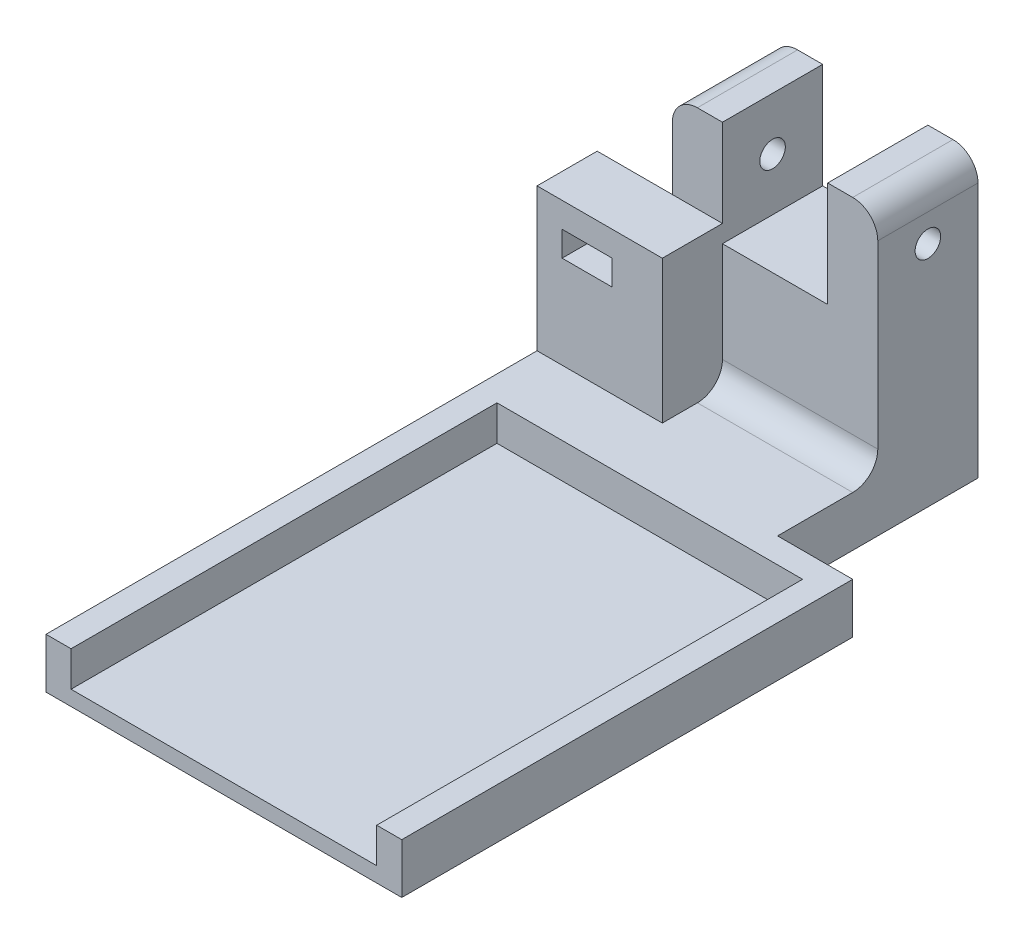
ISO-10303-21;
HEADER;
FILE_DESCRIPTION(('STEP AP214'),'2;1');
FILE_NAME('part.step','',(''),(''),'','','');
FILE_SCHEMA(('AUTOMOTIVE_DESIGN { 1 0 10303 214 1 1 1 1 }'));
ENDSEC;
DATA;
#1=APPLICATION_CONTEXT('core data for automotive mechanical design processes');
#2=APPLICATION_PROTOCOL_DEFINITION('international standard','automotive_design',2000,#1);
#3=PRODUCT_CONTEXT('',#1,'mechanical');
#4=PRODUCT('Part','Part','',(#3));
#5=PRODUCT_RELATED_PRODUCT_CATEGORY('part','',(#4));
#6=PRODUCT_DEFINITION_FORMATION('','',#4);
#7=PRODUCT_DEFINITION_CONTEXT('part definition',#1,'design');
#8=PRODUCT_DEFINITION('design','',#6,#7);
#9=PRODUCT_DEFINITION_SHAPE('','',#8);
#10=(LENGTH_UNIT() NAMED_UNIT(*) SI_UNIT(.MILLI.,.METRE.));
#11=(NAMED_UNIT(*) PLANE_ANGLE_UNIT() SI_UNIT($,.RADIAN.));
#12=(NAMED_UNIT(*) SI_UNIT($,.STERADIAN.) SOLID_ANGLE_UNIT());
#13=UNCERTAINTY_MEASURE_WITH_UNIT(LENGTH_MEASURE(1.E-05),#10,'distance_accuracy_value','');
#14=(GEOMETRIC_REPRESENTATION_CONTEXT(3) GLOBAL_UNCERTAINTY_ASSIGNED_CONTEXT((#13)) GLOBAL_UNIT_ASSIGNED_CONTEXT((#10,
#11,#12)) REPRESENTATION_CONTEXT('',''));
#15=CARTESIAN_POINT('',(0.,0.,0.));
#16=DIRECTION('',(0.,0.,1.));
#17=DIRECTION('',(1.,0.,0.));
#18=AXIS2_PLACEMENT_3D('',#15,#16,#17);
#19=CARTESIAN_POINT('',(-10.5,20.5,20.));
#20=DIRECTION('',(1.,0.,0.));
#21=DIRECTION('',(0.,1.,0.));
#22=AXIS2_PLACEMENT_3D('',#19,#20,#21);
#23=PLANE('',#22);
#24=DIRECTION('',(0.,-1.,0.));
#25=VECTOR('',#24,1.);
#26=CARTESIAN_POINT('',(-10.5,20.5,20.));
#27=LINE('',#26,#25);
#28=CARTESIAN_POINT('',(-10.5,15.5,20.));
#29=VERTEX_POINT('',#28);
#30=CARTESIAN_POINT('',(-10.5,3.,20.));
#31=VERTEX_POINT('',#30);
#32=EDGE_CURVE('E427',#29,#31,#27,.T.);
#33=ORIENTED_EDGE('',*,*,#32,.F.);
#34=DIRECTION('',(0.,0.,-1.));
#35=VECTOR('',#34,1.);
#36=CARTESIAN_POINT('',(-10.5,15.5,20.));
#37=LINE('',#36,#35);
#38=CARTESIAN_POINT('',(-10.5,15.5,0.));
#39=VERTEX_POINT('',#38);
#40=EDGE_CURVE('E518',#29,#39,#37,.T.);
#41=ORIENTED_EDGE('',*,*,#40,.T.);
#42=DIRECTION('',(0.,-1.,0.));
#43=VECTOR('',#42,1.);
#44=CARTESIAN_POINT('',(-10.5,20.5,0.));
#45=LINE('',#44,#43);
#46=CARTESIAN_POINT('',(-10.5,-35.5,0.));
#47=VERTEX_POINT('',#46);
#48=EDGE_CURVE('E450',#39,#47,#45,.T.);
#49=ORIENTED_EDGE('',*,*,#48,.T.);
#50=DIRECTION('',(0.,0.,-1.));
#51=VECTOR('',#50,1.);
#52=CARTESIAN_POINT('',(-10.5,-35.5,20.));
#53=LINE('',#52,#51);
#54=CARTESIAN_POINT('',(-10.5,-35.5,20.));
#55=VERTEX_POINT('',#54);
#56=EDGE_CURVE('E489',#55,#47,#53,.T.);
#57=ORIENTED_EDGE('',*,*,#56,.F.);
#58=DIRECTION('',(0.,-1.,0.));
#59=VECTOR('',#58,1.);
#60=CARTESIAN_POINT('',(-10.5,-25.5,20.));
#61=LINE('',#60,#59);
#62=CARTESIAN_POINT('',(-10.5,-7.00000000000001,20.));
#63=VERTEX_POINT('',#62);
#64=EDGE_CURVE('E284',#63,#55,#61,.T.);
#65=ORIENTED_EDGE('',*,*,#64,.F.);
#66=DIRECTION('',(0.,0.,1.));
#67=VECTOR('',#66,1.);
#68=CARTESIAN_POINT('',(-10.5,-7.00000000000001,0.));
#69=LINE('',#68,#67);
#70=CARTESIAN_POINT('',(-10.5,-7.00000000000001,32.));
#71=VERTEX_POINT('',#70);
#72=EDGE_CURVE('E241',#63,#71,#69,.T.);
#73=ORIENTED_EDGE('',*,*,#72,.T.);
#74=DIRECTION('',(0.,1.,0.));
#75=VECTOR('',#74,1.);
#76=CARTESIAN_POINT('',(-10.5,-2.00000000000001,32.));
#77=LINE('',#76,#75);
#78=CARTESIAN_POINT('',(-10.5,-2.00000000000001,32.));
#79=VERTEX_POINT('',#78);
#80=EDGE_CURVE('E257',#71,#79,#77,.T.);
#81=ORIENTED_EDGE('',*,*,#80,.T.);
#82=DIRECTION('',(0.,0.,1.));
#83=VECTOR('',#82,1.);
#84=CARTESIAN_POINT('',(-10.5,-2.00000000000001,0.));
#85=LINE('',#84,#83);
#86=CARTESIAN_POINT('',(-10.5,-2.00000000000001,20.));
#87=VERTEX_POINT('',#86);
#88=EDGE_CURVE('E264',#87,#79,#85,.T.);
#89=ORIENTED_EDGE('',*,*,#88,.F.);
#90=EDGE_CURVE('E290',#31,#87,#61,.T.);
#91=ORIENTED_EDGE('',*,*,#90,.F.);
#92=EDGE_LOOP('',(#33,#41,#49,#57,#65,#73,#81,#89,#91));
#93=FACE_BOUND('',#92,.T.);
#94=CARTESIAN_POINT('',(-10.5,9.99999999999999,10.));
#95=DIRECTION('',(-1.,0.,0.));
#96=DIRECTION('',(0.,-1.,0.));
#97=AXIS2_PLACEMENT_3D('',#94,#95,#96);
#98=CIRCLE('',#97,2.55);
#99=CARTESIAN_POINT('',(-10.5,7.44999999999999,10.));
#100=VERTEX_POINT('',#99);
#101=EDGE_CURVE('E267',#100,#100,#98,.T.);
#102=ORIENTED_EDGE('',*,*,#101,.F.);
#103=EDGE_LOOP('',(#102));
#104=FACE_BOUND('',#103,.T.);
#105=ADVANCED_FACE('F45',(#93,#104),#23,.F.);
#106=CARTESIAN_POINT('',(0.,0.,20.));
#107=DIRECTION('',(0.,0.,-1.));
#108=DIRECTION('',(-1.,0.,0.));
#109=AXIS2_PLACEMENT_3D('',#106,#107,#108);
#110=PLANE('',#109);
#111=DIRECTION('',(0.,-1.,0.));
#112=VECTOR('',#111,1.);
#113=CARTESIAN_POINT('',(-0.499999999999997,3.,20.));
#114=LINE('',#113,#112);
#115=CARTESIAN_POINT('',(-0.499999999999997,-0.5,20.));
#116=VERTEX_POINT('',#115);
#117=CARTESIAN_POINT('',(-0.499999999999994,-20.5,20.));
#118=VERTEX_POINT('',#117);
#119=EDGE_CURVE('E308',#116,#118,#114,.T.);
#120=ORIENTED_EDGE('',*,*,#119,.T.);
#121=DIRECTION('',(-1.,0.,0.));
#122=VECTOR('',#121,1.);
#123=CARTESIAN_POINT('',(30.5,-20.5,20.));
#124=LINE('',#123,#122);
#125=CARTESIAN_POINT('',(30.5,-20.5,20.));
#126=VERTEX_POINT('',#125);
#127=EDGE_CURVE('E515',#118,#126,#124,.F.);
#128=ORIENTED_EDGE('',*,*,#127,.T.);
#129=DIRECTION('',(0.,1.,0.));
#130=VECTOR('',#129,1.);
#131=CARTESIAN_POINT('',(30.5,-35.5,20.));
#132=LINE('',#131,#130);
#133=CARTESIAN_POINT('',(30.5,15.5,20.));
#134=VERTEX_POINT('',#133);
#135=EDGE_CURVE('E431',#126,#134,#132,.T.);
#136=ORIENTED_EDGE('',*,*,#135,.T.);
#137=CARTESIAN_POINT('',(25.5,15.5,20.));
#138=DIRECTION('',(0.,0.,-1.));
#139=DIRECTION('',(-1.,0.,0.));
#140=AXIS2_PLACEMENT_3D('',#137,#138,#139);
#141=CIRCLE('',#140,5.);
#142=CARTESIAN_POINT('',(25.5,20.5,20.));
#143=VERTEX_POINT('',#142);
#144=EDGE_CURVE('E512',#134,#143,#141,.F.);
#145=ORIENTED_EDGE('',*,*,#144,.T.);
#146=DIRECTION('',(-1.,0.,0.));
#147=VECTOR('',#146,1.);
#148=CARTESIAN_POINT('',(20.5,20.5,20.));
#149=LINE('',#148,#147);
#150=CARTESIAN_POINT('',(20.5,20.5,20.));
#151=VERTEX_POINT('',#150);
#152=EDGE_CURVE('E435',#143,#151,#149,.T.);
#153=ORIENTED_EDGE('',*,*,#152,.T.);
#154=DIRECTION('',(0.,-1.,0.));
#155=VECTOR('',#154,1.);
#156=CARTESIAN_POINT('',(20.5,20.5,20.));
#157=LINE('',#156,#155);
#158=CARTESIAN_POINT('',(20.5,-0.5,20.));
#159=VERTEX_POINT('',#158);
#160=EDGE_CURVE('E438',#151,#159,#157,.T.);
#161=ORIENTED_EDGE('',*,*,#160,.T.);
#162=DIRECTION('',(-1.,0.,0.));
#163=VECTOR('',#162,1.);
#164=CARTESIAN_POINT('',(-0.499999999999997,-0.5,20.));
#165=LINE('',#164,#163);
#166=EDGE_CURVE('E441',#159,#116,#165,.T.);
#167=ORIENTED_EDGE('',*,*,#166,.T.);
#168=EDGE_LOOP('',(#120,#128,#136,#145,#153,#161,#167));
#169=FACE_BOUND('',#168,.T.);
#170=ADVANCED_FACE('F544',(#169),#110,.F.);
#171=CARTESIAN_POINT('',(-10.5,-25.5,130.));
#172=DIRECTION('',(0.,-1.,0.));
#173=DIRECTION('',(0.,0.,-1.));
#174=AXIS2_PLACEMENT_3D('',#171,#172,#173);
#175=PLANE('',#174);
#176=DIRECTION('',(0.,0.,-1.));
#177=VECTOR('',#176,1.);
#178=CARTESIAN_POINT('',(30.5,-25.5,130.));
#179=LINE('',#178,#177);
#180=CARTESIAN_POINT('',(30.5,-25.5,40.));
#181=VERTEX_POINT('',#180);
#182=CARTESIAN_POINT('',(30.5,-25.5,25.));
#183=VERTEX_POINT('',#182);
#184=EDGE_CURVE('E419',#181,#183,#179,.T.);
#185=ORIENTED_EDGE('',*,*,#184,.T.);
#186=DIRECTION('',(-1.,0.,0.));
#187=VECTOR('',#186,1.);
#188=CARTESIAN_POINT('',(-0.499999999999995,-25.5,25.));
#189=LINE('',#188,#187);
#190=CARTESIAN_POINT('',(-0.499999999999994,-25.5,25.));
#191=VERTEX_POINT('',#190);
#192=EDGE_CURVE('E505',#183,#191,#189,.T.);
#193=ORIENTED_EDGE('',*,*,#192,.T.);
#194=DIRECTION('',(0.,0.,1.));
#195=VECTOR('',#194,1.);
#196=CARTESIAN_POINT('',(-0.499999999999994,-25.5,20.));
#197=LINE('',#196,#195);
#198=CARTESIAN_POINT('',(-0.499999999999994,-25.5,32.));
#199=VERTEX_POINT('',#198);
#200=EDGE_CURVE('E312',#191,#199,#197,.T.);
#201=ORIENTED_EDGE('',*,*,#200,.T.);
#202=DIRECTION('',(-1.,0.,0.));
#203=VECTOR('',#202,1.);
#204=CARTESIAN_POINT('',(-0.499999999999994,-25.5,32.));
#205=LINE('',#204,#203);
#206=CARTESIAN_POINT('',(-25.5,-25.5,32.));
#207=VERTEX_POINT('',#206);
#208=EDGE_CURVE('E323',#199,#207,#205,.T.);
#209=ORIENTED_EDGE('',*,*,#208,.T.);
#210=DIRECTION('',(0.,0.,-1.));
#211=VECTOR('',#210,1.);
#212=CARTESIAN_POINT('',(-25.5,-25.5,130.));
#213=LINE('',#212,#211);
#214=CARTESIAN_POINT('',(-25.5,-25.5,130.));
#215=VERTEX_POINT('',#214);
#216=EDGE_CURVE('E404',#215,#207,#213,.T.);
#217=ORIENTED_EDGE('',*,*,#216,.F.);
#218=DIRECTION('',(-1.,0.,0.));
#219=VECTOR('',#218,1.);
#220=CARTESIAN_POINT('',(-10.5,-25.5,130.));
#221=LINE('',#220,#219);
#222=CARTESIAN_POINT('',(-20.5,-25.5,130.));
#223=VERTEX_POINT('',#222);
#224=EDGE_CURVE('E414',#223,#215,#221,.T.);
#225=ORIENTED_EDGE('',*,*,#224,.F.);
#226=DIRECTION('',(0.,0.,1.));
#227=VECTOR('',#226,1.);
#228=CARTESIAN_POINT('',(-20.5,-25.5,45.));
#229=LINE('',#228,#227);
#230=CARTESIAN_POINT('',(-20.5,-25.5,45.));
#231=VERTEX_POINT('',#230);
#232=EDGE_CURVE('E346',#231,#223,#229,.T.);
#233=ORIENTED_EDGE('',*,*,#232,.F.);
#234=DIRECTION('',(-1.,0.,0.));
#235=VECTOR('',#234,1.);
#236=CARTESIAN_POINT('',(40.5,-25.5,45.));
#237=LINE('',#236,#235);
#238=CARTESIAN_POINT('',(40.5,-25.5,45.));
#239=VERTEX_POINT('',#238);
#240=EDGE_CURVE('E362',#239,#231,#237,.T.);
#241=ORIENTED_EDGE('',*,*,#240,.F.);
#242=DIRECTION('',(0.,0.,-1.));
#243=VECTOR('',#242,1.);
#244=CARTESIAN_POINT('',(40.5,-25.5,125.));
#245=LINE('',#244,#243);
#246=CARTESIAN_POINT('',(40.5,-25.5,130.));
#247=VERTEX_POINT('',#246);
#248=EDGE_CURVE('E351',#247,#239,#245,.T.);
#249=ORIENTED_EDGE('',*,*,#248,.F.);
#250=CARTESIAN_POINT('',(45.5,-25.5,130.));
#251=VERTEX_POINT('',#250);
#252=EDGE_CURVE('E415',#251,#247,#221,.T.);
#253=ORIENTED_EDGE('',*,*,#252,.F.);
#254=DIRECTION('',(0.,0.,1.));
#255=VECTOR('',#254,1.);
#256=CARTESIAN_POINT('',(45.5,-25.5,130.));
#257=LINE('',#256,#255);
#258=CARTESIAN_POINT('',(45.5,-25.5,40.));
#259=VERTEX_POINT('',#258);
#260=EDGE_CURVE('E385',#259,#251,#257,.T.);
#261=ORIENTED_EDGE('',*,*,#260,.F.);
#262=DIRECTION('',(-1.,0.,0.));
#263=VECTOR('',#262,1.);
#264=CARTESIAN_POINT('',(45.5,-25.5,40.));
#265=LINE('',#264,#263);
#266=EDGE_CURVE('E389',#259,#181,#265,.T.);
#267=ORIENTED_EDGE('',*,*,#266,.T.);
#268=EDGE_LOOP('',(#185,#193,#201,#209,#217,#225,#233,#241,#249,#253,#261,#267));
#269=FACE_BOUND('',#268,.T.);
#270=ADVANCED_FACE('F570',(#269),#175,.F.);
#271=CARTESIAN_POINT('',(30.5,-35.5,20.));
#272=DIRECTION('',(-1.,0.,0.));
#273=DIRECTION('',(0.,0.,1.));
#274=AXIS2_PLACEMENT_3D('',#271,#272,#273);
#275=PLANE('',#274);
#276=CARTESIAN_POINT('',(30.5,10.,10.));
#277=DIRECTION('',(-1.,0.,0.));
#278=DIRECTION('',(0.,0.,1.));
#279=AXIS2_PLACEMENT_3D('',#276,#277,#278);
#280=CIRCLE('',#279,2.55);
#281=CARTESIAN_POINT('',(30.5,10.,12.55));
#282=VERTEX_POINT('',#281);
#283=EDGE_CURVE('E280',#282,#282,#280,.T.);
#284=ORIENTED_EDGE('',*,*,#283,.T.);
#285=EDGE_LOOP('',(#284));
#286=FACE_BOUND('',#285,.T.);
#287=DIRECTION('',(0.,1.,0.));
#288=VECTOR('',#287,1.);
#289=CARTESIAN_POINT('',(30.5,-35.5,0.));
#290=LINE('',#289,#288);
#291=CARTESIAN_POINT('',(30.5,-35.5,0.));
#292=VERTEX_POINT('',#291);
#293=CARTESIAN_POINT('',(30.5,15.5,0.));
#294=VERTEX_POINT('',#293);
#295=EDGE_CURVE('E457',#292,#294,#290,.T.);
#296=ORIENTED_EDGE('',*,*,#295,.T.);
#297=DIRECTION('',(0.,0.,-1.));
#298=VECTOR('',#297,1.);
#299=CARTESIAN_POINT('',(30.5,15.5,20.));
#300=LINE('',#299,#298);
#301=EDGE_CURVE('E54',#294,#134,#300,.F.);
#302=ORIENTED_EDGE('',*,*,#301,.T.);
#303=ORIENTED_EDGE('',*,*,#135,.F.);
#304=CARTESIAN_POINT('',(30.5,-20.5,25.));
#305=DIRECTION('',(-1.,0.,0.));
#306=DIRECTION('',(0.,0.,1.));
#307=AXIS2_PLACEMENT_3D('',#304,#305,#306);
#308=CIRCLE('',#307,5.);
#309=EDGE_CURVE('E11',#126,#183,#308,.T.);
#310=ORIENTED_EDGE('',*,*,#309,.T.);
#311=ORIENTED_EDGE('',*,*,#184,.F.);
#312=DIRECTION('',(0.,1.,0.));
#313=VECTOR('',#312,1.);
#314=CARTESIAN_POINT('',(30.5,-35.5,40.));
#315=LINE('',#314,#313);
#316=CARTESIAN_POINT('',(30.5,-35.5,40.));
#317=VERTEX_POINT('',#316);
#318=EDGE_CURVE('E374',#317,#181,#315,.T.);
#319=ORIENTED_EDGE('',*,*,#318,.F.);
#320=DIRECTION('',(0.,0.,-1.));
#321=VECTOR('',#320,1.);
#322=CARTESIAN_POINT('',(30.5,-35.5,20.));
#323=LINE('',#322,#321);
#324=EDGE_CURVE('E486',#317,#292,#323,.T.);
#325=ORIENTED_EDGE('',*,*,#324,.T.);
#326=EDGE_LOOP('',(#296,#302,#303,#310,#311,#319,#325));
#327=FACE_BOUND('',#326,.T.);
#328=ADVANCED_FACE('F539',(#286,#327),#275,.F.);
#329=DIRECTION('',(-1.,0.,0.));
#330=VECTOR('',#329,1.);
#331=CARTESIAN_POINT('',(-10.5,20.5,20.));
#332=LINE('',#331,#330);
#333=CARTESIAN_POINT('',(-0.499999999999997,20.5,20.));
#334=VERTEX_POINT('',#333);
#335=CARTESIAN_POINT('',(-5.5,20.5,20.));
#336=VERTEX_POINT('',#335);
#337=EDGE_CURVE('E424',#334,#336,#332,.T.);
#338=ORIENTED_EDGE('',*,*,#337,.T.);
#339=CARTESIAN_POINT('',(-5.5,15.5,20.));
#340=DIRECTION('',(0.,0.,-1.));
#341=DIRECTION('',(-1.,0.,0.));
#342=AXIS2_PLACEMENT_3D('',#339,#340,#341);
#343=CIRCLE('',#342,5.);
#344=EDGE_CURVE('E529',#336,#29,#343,.F.);
#345=ORIENTED_EDGE('',*,*,#344,.T.);
#346=ORIENTED_EDGE('',*,*,#32,.T.);
#347=DIRECTION('',(-1.,0.,0.));
#348=VECTOR('',#347,1.);
#349=CARTESIAN_POINT('',(-0.499999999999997,3.,20.));
#350=LINE('',#349,#348);
#351=CARTESIAN_POINT('',(-0.499999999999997,3.,20.));
#352=VERTEX_POINT('',#351);
#353=EDGE_CURVE('E324',#352,#31,#350,.T.);
#354=ORIENTED_EDGE('',*,*,#353,.F.);
#355=DIRECTION('',(0.,1.,0.));
#356=VECTOR('',#355,1.);
#357=CARTESIAN_POINT('',(-0.499999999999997,20.5,20.));
#358=LINE('',#357,#356);
#359=EDGE_CURVE('E444',#352,#334,#358,.T.);
#360=ORIENTED_EDGE('',*,*,#359,.T.);
#361=EDGE_LOOP('',(#338,#345,#346,#354,#360));
#362=FACE_BOUND('',#361,.T.);
#363=ADVANCED_FACE('F595',(#362),#110,.F.);
#364=CARTESIAN_POINT('',(-10.5,20.5,20.));
#365=DIRECTION('',(0.,-1.,0.));
#366=DIRECTION('',(0.,0.,-1.));
#367=AXIS2_PLACEMENT_3D('',#364,#365,#366);
#368=PLANE('',#367);
#369=DIRECTION('',(-1.,0.,0.));
#370=VECTOR('',#369,1.);
#371=CARTESIAN_POINT('',(-10.5,20.5,0.));
#372=LINE('',#371,#370);
#373=CARTESIAN_POINT('',(-0.499999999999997,20.5,0.));
#374=VERTEX_POINT('',#373);
#375=CARTESIAN_POINT('',(-5.5,20.5,0.));
#376=VERTEX_POINT('',#375);
#377=EDGE_CURVE('E423',#374,#376,#372,.T.);
#378=ORIENTED_EDGE('',*,*,#377,.T.);
#379=DIRECTION('',(0.,0.,-1.));
#380=VECTOR('',#379,1.);
#381=CARTESIAN_POINT('',(-5.5,20.5,20.));
#382=LINE('',#381,#380);
#383=EDGE_CURVE('E61',#376,#336,#382,.F.);
#384=ORIENTED_EDGE('',*,*,#383,.T.);
#385=ORIENTED_EDGE('',*,*,#337,.F.);
#386=DIRECTION('',(0.,0.,-1.));
#387=VECTOR('',#386,1.);
#388=CARTESIAN_POINT('',(-0.499999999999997,20.5,20.));
#389=LINE('',#388,#387);
#390=EDGE_CURVE('E447',#334,#374,#389,.T.);
#391=ORIENTED_EDGE('',*,*,#390,.T.);
#392=EDGE_LOOP('',(#378,#384,#385,#391));
#393=FACE_BOUND('',#392,.T.);
#394=ADVANCED_FACE('F598',(#393),#368,.F.);
#395=CARTESIAN_POINT('',(-10.5,-35.5,20.));
#396=DIRECTION('',(0.,1.,0.));
#397=DIRECTION('',(0.,0.,1.));
#398=AXIS2_PLACEMENT_3D('',#395,#396,#397);
#399=PLANE('',#398);
#400=DIRECTION('',(1.,0.,0.));
#401=VECTOR('',#400,1.);
#402=CARTESIAN_POINT('',(-25.5,-35.5,20.));
#403=LINE('',#402,#401);
#404=CARTESIAN_POINT('',(-25.5,-35.5,20.));
#405=VERTEX_POINT('',#404);
#406=EDGE_CURVE('E304',#405,#55,#403,.T.);
#407=ORIENTED_EDGE('',*,*,#406,.T.);
#408=ORIENTED_EDGE('',*,*,#56,.T.);
#409=DIRECTION('',(1.,0.,0.));
#410=VECTOR('',#409,1.);
#411=CARTESIAN_POINT('',(-10.5,-35.5,0.));
#412=LINE('',#411,#410);
#413=EDGE_CURVE('E453',#47,#292,#412,.T.);
#414=ORIENTED_EDGE('',*,*,#413,.T.);
#415=ORIENTED_EDGE('',*,*,#324,.F.);
#416=DIRECTION('',(-1.,0.,0.));
#417=VECTOR('',#416,1.);
#418=CARTESIAN_POINT('',(45.5,-35.5,40.));
#419=LINE('',#418,#417);
#420=CARTESIAN_POINT('',(45.5,-35.5,40.));
#421=VERTEX_POINT('',#420);
#422=EDGE_CURVE('E396',#421,#317,#419,.T.);
#423=ORIENTED_EDGE('',*,*,#422,.F.);
#424=DIRECTION('',(0.,0.,-1.));
#425=VECTOR('',#424,1.);
#426=CARTESIAN_POINT('',(45.5,-35.5,130.));
#427=LINE('',#426,#425);
#428=CARTESIAN_POINT('',(45.5,-35.5,130.));
#429=VERTEX_POINT('',#428);
#430=EDGE_CURVE('E379',#429,#421,#427,.T.);
#431=ORIENTED_EDGE('',*,*,#430,.F.);
#432=DIRECTION('',(1.,0.,0.));
#433=VECTOR('',#432,1.);
#434=CARTESIAN_POINT('',(-10.5,-35.5,130.));
#435=LINE('',#434,#433);
#436=CARTESIAN_POINT('',(-25.5,-35.5,130.));
#437=VERTEX_POINT('',#436);
#438=EDGE_CURVE('E411',#437,#429,#435,.T.);
#439=ORIENTED_EDGE('',*,*,#438,.F.);
#440=DIRECTION('',(0.,0.,1.));
#441=VECTOR('',#440,1.);
#442=CARTESIAN_POINT('',(-25.5,-35.5,130.));
#443=LINE('',#442,#441);
#444=EDGE_CURVE('E407',#405,#437,#443,.T.);
#445=ORIENTED_EDGE('',*,*,#444,.F.);
#446=EDGE_LOOP('',(#407,#408,#414,#415,#423,#431,#439,#445));
#447=FACE_BOUND('',#446,.T.);
#448=ADVANCED_FACE('F580',(#447),#399,.F.);
#449=CARTESIAN_POINT('',(20.5,20.5,20.));
#450=DIRECTION('',(0.,-1.,0.));
#451=DIRECTION('',(1.,0.,0.));
#452=AXIS2_PLACEMENT_3D('',#449,#450,#451);
#453=PLANE('',#452);
#454=ORIENTED_EDGE('',*,*,#152,.F.);
#455=DIRECTION('',(0.,0.,-1.));
#456=VECTOR('',#455,1.);
#457=CARTESIAN_POINT('',(25.5,20.5,20.));
#458=LINE('',#457,#456);
#459=CARTESIAN_POINT('',(25.5,20.5,0.));
#460=VERTEX_POINT('',#459);
#461=EDGE_CURVE('E532',#143,#460,#458,.T.);
#462=ORIENTED_EDGE('',*,*,#461,.T.);
#463=DIRECTION('',(-1.,0.,0.));
#464=VECTOR('',#463,1.);
#465=CARTESIAN_POINT('',(20.5,20.5,0.));
#466=LINE('',#465,#464);
#467=CARTESIAN_POINT('',(20.5,20.5,0.));
#468=VERTEX_POINT('',#467);
#469=EDGE_CURVE('E460',#460,#468,#466,.T.);
#470=ORIENTED_EDGE('',*,*,#469,.T.);
#471=DIRECTION('',(0.,0.,-1.));
#472=VECTOR('',#471,1.);
#473=CARTESIAN_POINT('',(20.5,20.5,20.));
#474=LINE('',#473,#472);
#475=EDGE_CURVE('E482',#151,#468,#474,.T.);
#476=ORIENTED_EDGE('',*,*,#475,.F.);
#477=EDGE_LOOP('',(#454,#462,#470,#476));
#478=FACE_BOUND('',#477,.T.);
#479=ADVANCED_FACE('F549',(#478),#453,.F.);
#480=CARTESIAN_POINT('',(20.5,20.5,20.));
#481=DIRECTION('',(1.,0.,0.));
#482=DIRECTION('',(0.,1.,0.));
#483=AXIS2_PLACEMENT_3D('',#480,#481,#482);
#484=PLANE('',#483);
#485=CARTESIAN_POINT('',(20.5,10.,10.));
#486=DIRECTION('',(1.,0.,0.));
#487=DIRECTION('',(0.,1.,0.));
#488=AXIS2_PLACEMENT_3D('',#485,#486,#487);
#489=CIRCLE('',#488,2.55);
#490=CARTESIAN_POINT('',(20.5,12.55,10.));
#491=VERTEX_POINT('',#490);
#492=EDGE_CURVE('E276',#491,#491,#489,.T.);
#493=ORIENTED_EDGE('',*,*,#492,.T.);
#494=EDGE_LOOP('',(#493));
#495=FACE_BOUND('',#494,.T.);
#496=DIRECTION('',(0.,-1.,0.));
#497=VECTOR('',#496,1.);
#498=CARTESIAN_POINT('',(20.5,20.5,0.));
#499=LINE('',#498,#497);
#500=CARTESIAN_POINT('',(20.5,-0.5,0.));
#501=VERTEX_POINT('',#500);
#502=EDGE_CURVE('E463',#468,#501,#499,.T.);
#503=ORIENTED_EDGE('',*,*,#502,.T.);
#504=DIRECTION('',(0.,0.,-1.));
#505=VECTOR('',#504,1.);
#506=CARTESIAN_POINT('',(20.5,-0.5,20.));
#507=LINE('',#506,#505);
#508=EDGE_CURVE('E478',#159,#501,#507,.T.);
#509=ORIENTED_EDGE('',*,*,#508,.F.);
#510=ORIENTED_EDGE('',*,*,#160,.F.);
#511=ORIENTED_EDGE('',*,*,#475,.T.);
#512=EDGE_LOOP('',(#503,#509,#510,#511));
#513=FACE_BOUND('',#512,.T.);
#514=ADVANCED_FACE('F558',(#495,#513),#484,.F.);
#515=CARTESIAN_POINT('',(-0.499999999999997,-0.5,20.));
#516=DIRECTION('',(0.,-1.,0.));
#517=DIRECTION('',(0.,0.,-1.));
#518=AXIS2_PLACEMENT_3D('',#515,#516,#517);
#519=PLANE('',#518);
#520=DIRECTION('',(-1.,0.,0.));
#521=VECTOR('',#520,1.);
#522=CARTESIAN_POINT('',(-0.499999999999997,-0.5,0.));
#523=LINE('',#522,#521);
#524=CARTESIAN_POINT('',(-0.499999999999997,-0.5,0.));
#525=VERTEX_POINT('',#524);
#526=EDGE_CURVE('E466',#501,#525,#523,.T.);
#527=ORIENTED_EDGE('',*,*,#526,.T.);
#528=DIRECTION('',(0.,0.,-1.));
#529=VECTOR('',#528,1.);
#530=CARTESIAN_POINT('',(-0.499999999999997,-0.5,20.));
#531=LINE('',#530,#529);
#532=EDGE_CURVE('E474',#116,#525,#531,.T.);
#533=ORIENTED_EDGE('',*,*,#532,.F.);
#534=ORIENTED_EDGE('',*,*,#166,.F.);
#535=ORIENTED_EDGE('',*,*,#508,.T.);
#536=EDGE_LOOP('',(#527,#533,#534,#535));
#537=FACE_BOUND('',#536,.T.);
#538=ADVANCED_FACE('F562',(#537),#519,.F.);
#539=CARTESIAN_POINT('',(-0.499999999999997,20.5,20.));
#540=DIRECTION('',(-1.,0.,0.));
#541=DIRECTION('',(0.,0.,1.));
#542=AXIS2_PLACEMENT_3D('',#539,#540,#541);
#543=PLANE('',#542);
#544=CARTESIAN_POINT('',(-0.5,9.99999999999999,10.));
#545=DIRECTION('',(-1.,0.,0.));
#546=DIRECTION('',(0.,0.,1.));
#547=AXIS2_PLACEMENT_3D('',#544,#545,#546);
#548=CIRCLE('',#547,2.55);
#549=CARTESIAN_POINT('',(-0.5,9.99999999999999,12.55));
#550=VERTEX_POINT('',#549);
#551=EDGE_CURVE('E275',#550,#550,#548,.T.);
#552=ORIENTED_EDGE('',*,*,#551,.T.);
#553=EDGE_LOOP('',(#552));
#554=FACE_BOUND('',#553,.T.);
#555=ORIENTED_EDGE('',*,*,#200,.F.);
#556=CARTESIAN_POINT('',(-0.499999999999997,-20.5,25.));
#557=DIRECTION('',(-1.,0.,0.));
#558=DIRECTION('',(0.,0.,1.));
#559=AXIS2_PLACEMENT_3D('',#556,#557,#558);
#560=CIRCLE('',#559,5.);
#561=EDGE_CURVE('E509',#191,#118,#560,.F.);
#562=ORIENTED_EDGE('',*,*,#561,.T.);
#563=ORIENTED_EDGE('',*,*,#119,.F.);
#564=ORIENTED_EDGE('',*,*,#532,.T.);
#565=DIRECTION('',(0.,1.,0.));
#566=VECTOR('',#565,1.);
#567=CARTESIAN_POINT('',(-0.499999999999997,20.5,0.));
#568=LINE('',#567,#566);
#569=EDGE_CURVE('E428',#525,#374,#568,.T.);
#570=ORIENTED_EDGE('',*,*,#569,.T.);
#571=ORIENTED_EDGE('',*,*,#390,.F.);
#572=ORIENTED_EDGE('',*,*,#359,.F.);
#573=DIRECTION('',(0.,0.,-1.));
#574=VECTOR('',#573,1.);
#575=CARTESIAN_POINT('',(-0.499999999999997,3.,20.));
#576=LINE('',#575,#574);
#577=CARTESIAN_POINT('',(-0.499999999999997,3.,32.));
#578=VERTEX_POINT('',#577);
#579=EDGE_CURVE('E319',#578,#352,#576,.T.);
#580=ORIENTED_EDGE('',*,*,#579,.F.);
#581=DIRECTION('',(0.,1.,0.));
#582=VECTOR('',#581,1.);
#583=CARTESIAN_POINT('',(-0.499999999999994,-25.5,32.));
#584=LINE('',#583,#582);
#585=EDGE_CURVE('E315',#199,#578,#584,.T.);
#586=ORIENTED_EDGE('',*,*,#585,.F.);
#587=EDGE_LOOP('',(#555,#562,#563,#564,#570,#571,#572,#580,#586));
#588=FACE_BOUND('',#587,.T.);
#589=ADVANCED_FACE('F599',(#554,#588),#543,.F.);
#590=CARTESIAN_POINT('',(0.,0.,0.));
#591=DIRECTION('',(0.,0.,-1.));
#592=DIRECTION('',(-1.,0.,0.));
#593=AXIS2_PLACEMENT_3D('',#590,#591,#592);
#594=PLANE('',#593);
#595=ORIENTED_EDGE('',*,*,#48,.F.);
#596=CARTESIAN_POINT('',(-5.5,15.5,0.));
#597=DIRECTION('',(0.,0.,-1.));
#598=DIRECTION('',(-1.,0.,0.));
#599=AXIS2_PLACEMENT_3D('',#596,#597,#598);
#600=CIRCLE('',#599,5.);
#601=EDGE_CURVE('E524',#39,#376,#600,.T.);
#602=ORIENTED_EDGE('',*,*,#601,.T.);
#603=ORIENTED_EDGE('',*,*,#377,.F.);
#604=ORIENTED_EDGE('',*,*,#569,.F.);
#605=ORIENTED_EDGE('',*,*,#526,.F.);
#606=ORIENTED_EDGE('',*,*,#502,.F.);
#607=ORIENTED_EDGE('',*,*,#469,.F.);
#608=CARTESIAN_POINT('',(25.5,15.5,0.));
#609=DIRECTION('',(0.,0.,-1.));
#610=DIRECTION('',(-1.,0.,0.));
#611=AXIS2_PLACEMENT_3D('',#608,#609,#610);
#612=CIRCLE('',#611,5.);
#613=EDGE_CURVE('E69',#460,#294,#612,.T.);
#614=ORIENTED_EDGE('',*,*,#613,.T.);
#615=ORIENTED_EDGE('',*,*,#295,.F.);
#616=ORIENTED_EDGE('',*,*,#413,.F.);
#617=EDGE_LOOP('',(#595,#602,#603,#604,#605,#606,#607,#614,#615,#616));
#618=FACE_BOUND('',#617,.T.);
#619=ADVANCED_FACE('F553',(#618),#594,.T.);
#620=CARTESIAN_POINT('',(0.,0.,130.));
#621=DIRECTION('',(0.,0.,-1.));
#622=DIRECTION('',(-1.,0.,0.));
#623=AXIS2_PLACEMENT_3D('',#620,#621,#622);
#624=PLANE('',#623);
#625=DIRECTION('',(-1.,0.,0.));
#626=VECTOR('',#625,1.);
#627=CARTESIAN_POINT('',(0.,-32.5,130.));
#628=LINE('',#627,#626);
#629=CARTESIAN_POINT('',(40.5,-32.5,130.));
#630=VERTEX_POINT('',#629);
#631=CARTESIAN_POINT('',(-20.5,-32.5,130.));
#632=VERTEX_POINT('',#631);
#633=EDGE_CURVE('E338',#630,#632,#628,.T.);
#634=ORIENTED_EDGE('',*,*,#633,.T.);
#635=DIRECTION('',(0.,1.,0.));
#636=VECTOR('',#635,1.);
#637=CARTESIAN_POINT('',(-20.5,0.,130.));
#638=LINE('',#637,#636);
#639=EDGE_CURVE('E342',#632,#223,#638,.T.);
#640=ORIENTED_EDGE('',*,*,#639,.T.);
#641=ORIENTED_EDGE('',*,*,#224,.T.);
#642=DIRECTION('',(0.,1.,0.));
#643=VECTOR('',#642,1.);
#644=CARTESIAN_POINT('',(-25.5,-35.5,130.));
#645=LINE('',#644,#643);
#646=EDGE_CURVE('E400',#437,#215,#645,.T.);
#647=ORIENTED_EDGE('',*,*,#646,.F.);
#648=ORIENTED_EDGE('',*,*,#438,.T.);
#649=DIRECTION('',(0.,-1.,0.));
#650=VECTOR('',#649,1.);
#651=CARTESIAN_POINT('',(45.5,-35.5,130.));
#652=LINE('',#651,#650);
#653=EDGE_CURVE('E375',#251,#429,#652,.T.);
#654=ORIENTED_EDGE('',*,*,#653,.F.);
#655=ORIENTED_EDGE('',*,*,#252,.T.);
#656=DIRECTION('',(0.,-1.,0.));
#657=VECTOR('',#656,1.);
#658=CARTESIAN_POINT('',(40.5,0.,130.));
#659=LINE('',#658,#657);
#660=EDGE_CURVE('E328',#247,#630,#659,.T.);
#661=ORIENTED_EDGE('',*,*,#660,.T.);
#662=EDGE_LOOP('',(#634,#640,#641,#647,#648,#654,#655,#661));
#663=FACE_BOUND('',#662,.T.);
#664=ADVANCED_FACE('F608',(#663),#624,.F.);
#665=CARTESIAN_POINT('',(-25.5,0.,0.));
#666=DIRECTION('',(-1.,0.,0.));
#667=DIRECTION('',(0.,-1.,0.));
#668=AXIS2_PLACEMENT_3D('',#665,#666,#667);
#669=PLANE('',#668);
#670=ORIENTED_EDGE('',*,*,#646,.T.);
#671=ORIENTED_EDGE('',*,*,#216,.T.);
#672=DIRECTION('',(0.,1.,0.));
#673=VECTOR('',#672,1.);
#674=CARTESIAN_POINT('',(-25.5,3.,32.));
#675=LINE('',#674,#673);
#676=CARTESIAN_POINT('',(-25.5,3.,32.));
#677=VERTEX_POINT('',#676);
#678=EDGE_CURVE('E289',#207,#677,#675,.T.);
#679=ORIENTED_EDGE('',*,*,#678,.T.);
#680=DIRECTION('',(0.,0.,-1.));
#681=VECTOR('',#680,1.);
#682=CARTESIAN_POINT('',(-25.5,3.,20.));
#683=LINE('',#682,#681);
#684=CARTESIAN_POINT('',(-25.5,3.,20.));
#685=VERTEX_POINT('',#684);
#686=EDGE_CURVE('E294',#677,#685,#683,.T.);
#687=ORIENTED_EDGE('',*,*,#686,.T.);
#688=DIRECTION('',(0.,-1.,0.));
#689=VECTOR('',#688,1.);
#690=CARTESIAN_POINT('',(-25.5,3.,20.));
#691=LINE('',#690,#689);
#692=EDGE_CURVE('E285',#685,#405,#691,.T.);
#693=ORIENTED_EDGE('',*,*,#692,.T.);
#694=ORIENTED_EDGE('',*,*,#444,.T.);
#695=EDGE_LOOP('',(#670,#671,#679,#687,#693,#694));
#696=FACE_BOUND('',#695,.T.);
#697=ADVANCED_FACE('F733',(#696),#669,.T.);
#698=CARTESIAN_POINT('',(45.5,-35.5,40.));
#699=DIRECTION('',(0.,0.,1.));
#700=DIRECTION('',(1.,0.,0.));
#701=AXIS2_PLACEMENT_3D('',#698,#699,#700);
#702=PLANE('',#701);
#703=ORIENTED_EDGE('',*,*,#318,.T.);
#704=ORIENTED_EDGE('',*,*,#266,.F.);
#705=DIRECTION('',(0.,1.,0.));
#706=VECTOR('',#705,1.);
#707=CARTESIAN_POINT('',(45.5,-35.5,40.));
#708=LINE('',#707,#706);
#709=EDGE_CURVE('E382',#421,#259,#708,.T.);
#710=ORIENTED_EDGE('',*,*,#709,.F.);
#711=ORIENTED_EDGE('',*,*,#422,.T.);
#712=EDGE_LOOP('',(#703,#704,#710,#711));
#713=FACE_BOUND('',#712,.T.);
#714=ADVANCED_FACE('F576',(#713),#702,.F.);
#715=CARTESIAN_POINT('',(45.5,0.,0.));
#716=DIRECTION('',(-1.,0.,0.));
#717=DIRECTION('',(0.,0.,1.));
#718=AXIS2_PLACEMENT_3D('',#715,#716,#717);
#719=PLANE('',#718);
#720=ORIENTED_EDGE('',*,*,#653,.T.);
#721=ORIENTED_EDGE('',*,*,#430,.T.);
#722=ORIENTED_EDGE('',*,*,#709,.T.);
#723=ORIENTED_EDGE('',*,*,#260,.T.);
#724=EDGE_LOOP('',(#720,#721,#722,#723));
#725=FACE_BOUND('',#724,.T.);
#726=ADVANCED_FACE('F786',(#725),#719,.F.);
#727=CARTESIAN_POINT('',(-20.5,-32.5,45.));
#728=DIRECTION('',(-1.,0.,0.));
#729=DIRECTION('',(0.,0.,1.));
#730=AXIS2_PLACEMENT_3D('',#727,#728,#729);
#731=PLANE('',#730);
#732=ORIENTED_EDGE('',*,*,#232,.T.);
#733=ORIENTED_EDGE('',*,*,#639,.F.);
#734=DIRECTION('',(0.,0.,1.));
#735=VECTOR('',#734,1.);
#736=CARTESIAN_POINT('',(-20.5,-32.5,45.));
#737=LINE('',#736,#735);
#738=CARTESIAN_POINT('',(-20.5,-32.5,45.));
#739=VERTEX_POINT('',#738);
#740=EDGE_CURVE('E347',#739,#632,#737,.T.);
#741=ORIENTED_EDGE('',*,*,#740,.F.);
#742=DIRECTION('',(0.,1.,0.));
#743=VECTOR('',#742,1.);
#744=CARTESIAN_POINT('',(-20.5,-32.5,45.));
#745=LINE('',#744,#743);
#746=EDGE_CURVE('E371',#739,#231,#745,.T.);
#747=ORIENTED_EDGE('',*,*,#746,.T.);
#748=EDGE_LOOP('',(#732,#733,#741,#747));
#749=FACE_BOUND('',#748,.T.);
#750=ADVANCED_FACE('F783',(#749),#731,.F.);
#751=CARTESIAN_POINT('',(40.5,-32.5,45.));
#752=DIRECTION('',(0.,0.,-1.));
#753=DIRECTION('',(-1.,0.,0.));
#754=AXIS2_PLACEMENT_3D('',#751,#752,#753);
#755=PLANE('',#754);
#756=ORIENTED_EDGE('',*,*,#240,.T.);
#757=ORIENTED_EDGE('',*,*,#746,.F.);
#758=DIRECTION('',(-1.,0.,0.));
#759=VECTOR('',#758,1.);
#760=CARTESIAN_POINT('',(40.5,-32.5,45.));
#761=LINE('',#760,#759);
#762=CARTESIAN_POINT('',(40.5,-32.5,45.));
#763=VERTEX_POINT('',#762);
#764=EDGE_CURVE('E350',#763,#739,#761,.T.);
#765=ORIENTED_EDGE('',*,*,#764,.F.);
#766=DIRECTION('',(0.,1.,0.));
#767=VECTOR('',#766,1.);
#768=CARTESIAN_POINT('',(40.5,-32.5,45.));
#769=LINE('',#768,#767);
#770=EDGE_CURVE('E359',#763,#239,#769,.T.);
#771=ORIENTED_EDGE('',*,*,#770,.T.);
#772=EDGE_LOOP('',(#756,#757,#765,#771));
#773=FACE_BOUND('',#772,.T.);
#774=ADVANCED_FACE('F776',(#773),#755,.F.);
#775=CARTESIAN_POINT('',(40.5,-32.5,125.));
#776=DIRECTION('',(1.,0.,0.));
#777=DIRECTION('',(0.,0.,-1.));
#778=AXIS2_PLACEMENT_3D('',#775,#776,#777);
#779=PLANE('',#778);
#780=ORIENTED_EDGE('',*,*,#248,.T.);
#781=ORIENTED_EDGE('',*,*,#770,.F.);
#782=DIRECTION('',(0.,0.,-1.));
#783=VECTOR('',#782,1.);
#784=CARTESIAN_POINT('',(40.5,-32.5,125.));
#785=LINE('',#784,#783);
#786=EDGE_CURVE('E355',#630,#763,#785,.T.);
#787=ORIENTED_EDGE('',*,*,#786,.F.);
#788=ORIENTED_EDGE('',*,*,#660,.F.);
#789=EDGE_LOOP('',(#780,#781,#787,#788));
#790=FACE_BOUND('',#789,.T.);
#791=ADVANCED_FACE('F766',(#790),#779,.F.);
#792=CARTESIAN_POINT('',(0.,-32.5,0.));
#793=DIRECTION('',(0.,1.,0.));
#794=DIRECTION('',(0.,0.,1.));
#795=AXIS2_PLACEMENT_3D('',#792,#793,#794);
#796=PLANE('',#795);
#797=ORIENTED_EDGE('',*,*,#740,.T.);
#798=ORIENTED_EDGE('',*,*,#633,.F.);
#799=ORIENTED_EDGE('',*,*,#786,.T.);
#800=ORIENTED_EDGE('',*,*,#764,.T.);
#801=EDGE_LOOP('',(#797,#798,#799,#800));
#802=FACE_BOUND('',#801,.T.);
#803=ADVANCED_FACE('F725',(#802),#796,.T.);
#804=CARTESIAN_POINT('',(-0.499999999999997,3.,20.));
#805=DIRECTION('',(0.,1.,0.));
#806=DIRECTION('',(-1.,0.,0.));
#807=AXIS2_PLACEMENT_3D('',#804,#805,#806);
#808=PLANE('',#807);
#809=ORIENTED_EDGE('',*,*,#353,.T.);
#810=DIRECTION('',(1.,0.,0.));
#811=VECTOR('',#810,1.);
#812=CARTESIAN_POINT('',(-25.5,3.,20.));
#813=LINE('',#812,#811);
#814=EDGE_CURVE('E297',#685,#31,#813,.T.);
#815=ORIENTED_EDGE('',*,*,#814,.F.);
#816=ORIENTED_EDGE('',*,*,#686,.F.);
#817=DIRECTION('',(-1.,0.,0.));
#818=VECTOR('',#817,1.);
#819=CARTESIAN_POINT('',(-0.499999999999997,3.,32.));
#820=LINE('',#819,#818);
#821=EDGE_CURVE('E329',#578,#677,#820,.T.);
#822=ORIENTED_EDGE('',*,*,#821,.F.);
#823=ORIENTED_EDGE('',*,*,#579,.T.);
#824=EDGE_LOOP('',(#809,#815,#816,#822,#823));
#825=FACE_BOUND('',#824,.T.);
#826=ADVANCED_FACE('F711',(#825),#808,.T.);
#827=CARTESIAN_POINT('',(-0.499999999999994,-25.5,32.));
#828=DIRECTION('',(0.,0.,1.));
#829=DIRECTION('',(1.,0.,0.));
#830=AXIS2_PLACEMENT_3D('',#827,#828,#829);
#831=PLANE('',#830);
#832=DIRECTION('',(-1.,0.,0.));
#833=VECTOR('',#832,1.);
#834=CARTESIAN_POINT('',(-20.5,-2.00000000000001,32.));
#835=LINE('',#834,#833);
#836=CARTESIAN_POINT('',(-20.5,-2.00000000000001,32.));
#837=VERTEX_POINT('',#836);
#838=EDGE_CURVE('E252',#79,#837,#835,.T.);
#839=ORIENTED_EDGE('',*,*,#838,.F.);
#840=ORIENTED_EDGE('',*,*,#80,.F.);
#841=DIRECTION('',(1.,0.,0.));
#842=VECTOR('',#841,1.);
#843=CARTESIAN_POINT('',(-10.5,-7.00000000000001,32.));
#844=LINE('',#843,#842);
#845=CARTESIAN_POINT('',(-20.5,-7.00000000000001,32.));
#846=VERTEX_POINT('',#845);
#847=EDGE_CURVE('E234',#846,#71,#844,.T.);
#848=ORIENTED_EDGE('',*,*,#847,.F.);
#849=DIRECTION('',(0.,-1.,0.));
#850=VECTOR('',#849,1.);
#851=CARTESIAN_POINT('',(-20.5,-2.00000000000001,32.));
#852=LINE('',#851,#850);
#853=EDGE_CURVE('E246',#837,#846,#852,.T.);
#854=ORIENTED_EDGE('',*,*,#853,.F.);
#855=EDGE_LOOP('',(#839,#840,#848,#854));
#856=FACE_BOUND('',#855,.T.);
#857=ORIENTED_EDGE('',*,*,#821,.T.);
#858=ORIENTED_EDGE('',*,*,#678,.F.);
#859=ORIENTED_EDGE('',*,*,#208,.F.);
#860=ORIENTED_EDGE('',*,*,#585,.T.);
#861=EDGE_LOOP('',(#857,#858,#859,#860));
#862=FACE_BOUND('',#861,.T.);
#863=ADVANCED_FACE('F254',(#856,#862),#831,.T.);
#864=CARTESIAN_POINT('',(-25.5,-25.5,20.));
#865=DIRECTION('',(0.,0.,1.));
#866=DIRECTION('',(1.,0.,0.));
#867=AXIS2_PLACEMENT_3D('',#864,#865,#866);
#868=PLANE('',#867);
#869=ORIENTED_EDGE('',*,*,#90,.T.);
#870=DIRECTION('',(-1.,0.,0.));
#871=VECTOR('',#870,1.);
#872=CARTESIAN_POINT('',(-25.5,-2.00000000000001,20.));
#873=LINE('',#872,#871);
#874=CARTESIAN_POINT('',(-20.5,-2.00000000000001,20.));
#875=VERTEX_POINT('',#874);
#876=EDGE_CURVE('E501',#87,#875,#873,.T.);
#877=ORIENTED_EDGE('',*,*,#876,.T.);
#878=DIRECTION('',(0.,-1.,0.));
#879=VECTOR('',#878,1.);
#880=CARTESIAN_POINT('',(-20.5,-25.5,20.));
#881=LINE('',#880,#879);
#882=CARTESIAN_POINT('',(-20.5,-7.00000000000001,20.));
#883=VERTEX_POINT('',#882);
#884=EDGE_CURVE('E493',#875,#883,#881,.T.);
#885=ORIENTED_EDGE('',*,*,#884,.T.);
#886=DIRECTION('',(1.,0.,0.));
#887=VECTOR('',#886,1.);
#888=CARTESIAN_POINT('',(-25.5,-7.00000000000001,20.));
#889=LINE('',#888,#887);
#890=EDGE_CURVE('E237',#883,#63,#889,.T.);
#891=ORIENTED_EDGE('',*,*,#890,.T.);
#892=ORIENTED_EDGE('',*,*,#64,.T.);
#893=ORIENTED_EDGE('',*,*,#406,.F.);
#894=ORIENTED_EDGE('',*,*,#692,.F.);
#895=ORIENTED_EDGE('',*,*,#814,.T.);
#896=EDGE_LOOP('',(#869,#877,#885,#891,#892,#893,#894,#895));
#897=FACE_BOUND('',#896,.T.);
#898=ADVANCED_FACE('F696',(#897),#868,.F.);
#899=CARTESIAN_POINT('',(45.5,10.,10.));
#900=DIRECTION('',(-1.,0.,0.));
#901=DIRECTION('',(0.,-1.,0.));
#902=AXIS2_PLACEMENT_3D('',#899,#900,#901);
#903=CYLINDRICAL_SURFACE('',#902,2.55);
#904=ORIENTED_EDGE('',*,*,#101,.T.);
#905=EDGE_LOOP('',(#904));
#906=FACE_BOUND('',#905,.T.);
#907=ORIENTED_EDGE('',*,*,#551,.F.);
#908=EDGE_LOOP('',(#907));
#909=FACE_BOUND('',#908,.T.);
#910=ADVANCED_FACE('F685',(#906,#909),#903,.F.);
#911=ORIENTED_EDGE('',*,*,#492,.F.);
#912=EDGE_LOOP('',(#911));
#913=FACE_BOUND('',#912,.T.);
#914=ORIENTED_EDGE('',*,*,#283,.F.);
#915=EDGE_LOOP('',(#914));
#916=FACE_BOUND('',#915,.T.);
#917=ADVANCED_FACE('F666',(#913,#916),#903,.F.);
#918=CARTESIAN_POINT('',(-20.5,-2.00000000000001,0.));
#919=DIRECTION('',(0.,1.,0.));
#920=DIRECTION('',(0.,0.,1.));
#921=AXIS2_PLACEMENT_3D('',#918,#919,#920);
#922=PLANE('',#921);
#923=ORIENTED_EDGE('',*,*,#88,.T.);
#924=ORIENTED_EDGE('',*,*,#838,.T.);
#925=DIRECTION('',(0.,0.,1.));
#926=VECTOR('',#925,1.);
#927=CARTESIAN_POINT('',(-20.5,-2.00000000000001,0.));
#928=LINE('',#927,#926);
#929=EDGE_CURVE('E242',#875,#837,#928,.T.);
#930=ORIENTED_EDGE('',*,*,#929,.F.);
#931=ORIENTED_EDGE('',*,*,#876,.F.);
#932=EDGE_LOOP('',(#923,#924,#930,#931));
#933=FACE_BOUND('',#932,.T.);
#934=ADVANCED_FACE('F658',(#933),#922,.F.);
#935=CARTESIAN_POINT('',(-10.5,-7.00000000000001,0.));
#936=DIRECTION('',(0.,-1.,0.));
#937=DIRECTION('',(1.,0.,0.));
#938=AXIS2_PLACEMENT_3D('',#935,#936,#937);
#939=PLANE('',#938);
#940=DIRECTION('',(0.,0.,1.));
#941=VECTOR('',#940,1.);
#942=CARTESIAN_POINT('',(-20.5,-7.00000000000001,0.));
#943=LINE('',#942,#941);
#944=EDGE_CURVE('E230',#883,#846,#943,.T.);
#945=ORIENTED_EDGE('',*,*,#944,.T.);
#946=ORIENTED_EDGE('',*,*,#847,.T.);
#947=ORIENTED_EDGE('',*,*,#72,.F.);
#948=ORIENTED_EDGE('',*,*,#890,.F.);
#949=EDGE_LOOP('',(#945,#946,#947,#948));
#950=FACE_BOUND('',#949,.T.);
#951=ADVANCED_FACE('F232',(#950),#939,.F.);
#952=CARTESIAN_POINT('',(-20.5,-2.00000000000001,0.));
#953=DIRECTION('',(-1.,0.,0.));
#954=DIRECTION('',(0.,0.,1.));
#955=AXIS2_PLACEMENT_3D('',#952,#953,#954);
#956=PLANE('',#955);
#957=ORIENTED_EDGE('',*,*,#929,.T.);
#958=ORIENTED_EDGE('',*,*,#853,.T.);
#959=ORIENTED_EDGE('',*,*,#944,.F.);
#960=ORIENTED_EDGE('',*,*,#884,.F.);
#961=EDGE_LOOP('',(#957,#958,#959,#960));
#962=FACE_BOUND('',#961,.T.);
#963=ADVANCED_FACE('F247',(#962),#956,.F.);
#964=CARTESIAN_POINT('',(-10.5,-20.5,25.));
#965=DIRECTION('',(1.,0.,0.));
#966=DIRECTION('',(0.,0.,-1.));
#967=AXIS2_PLACEMENT_3D('',#964,#965,#966);
#968=CYLINDRICAL_SURFACE('',#967,5.);
#969=ORIENTED_EDGE('',*,*,#309,.F.);
#970=ORIENTED_EDGE('',*,*,#127,.F.);
#971=ORIENTED_EDGE('',*,*,#561,.F.);
#972=ORIENTED_EDGE('',*,*,#192,.F.);
#973=EDGE_LOOP('',(#969,#970,#971,#972));
#974=FACE_BOUND('',#973,.T.);
#975=ADVANCED_FACE('F567',(#974),#968,.F.);
#976=CARTESIAN_POINT('',(-5.5,15.5,20.));
#977=DIRECTION('',(0.,0.,-1.));
#978=DIRECTION('',(-1.,0.,0.));
#979=AXIS2_PLACEMENT_3D('',#976,#977,#978);
#980=CYLINDRICAL_SURFACE('',#979,5.);
#981=ORIENTED_EDGE('',*,*,#344,.F.);
#982=ORIENTED_EDGE('',*,*,#383,.F.);
#983=ORIENTED_EDGE('',*,*,#601,.F.);
#984=ORIENTED_EDGE('',*,*,#40,.F.);
#985=EDGE_LOOP('',(#981,#982,#983,#984));
#986=FACE_BOUND('',#985,.T.);
#987=ADVANCED_FACE('F593',(#986),#980,.T.);
#988=CARTESIAN_POINT('',(25.5,15.5,20.));
#989=DIRECTION('',(0.,0.,-1.));
#990=DIRECTION('',(-1.,0.,0.));
#991=AXIS2_PLACEMENT_3D('',#988,#989,#990);
#992=CYLINDRICAL_SURFACE('',#991,5.);
#993=ORIENTED_EDGE('',*,*,#144,.F.);
#994=ORIENTED_EDGE('',*,*,#301,.F.);
#995=ORIENTED_EDGE('',*,*,#613,.F.);
#996=ORIENTED_EDGE('',*,*,#461,.F.);
#997=EDGE_LOOP('',(#993,#994,#995,#996));
#998=FACE_BOUND('',#997,.T.);
#999=ADVANCED_FACE('F47',(#998),#992,.T.);
#1000=CLOSED_SHELL('',(#105,#170,#270,#328,#363,#394,#448,#479,#514,#538,#589,#619,#664,#697,
#714,#726,#750,#774,#791,#803,#826,#863,#898,#910,#917,#934,#951,#963,#975,#987,#999));
#1001=MANIFOLD_SOLID_BREP('B2',#1000);
#1002=ADVANCED_BREP_SHAPE_REPRESENTATION('',(#18,#1001),#14);
#1003=SHAPE_DEFINITION_REPRESENTATION(#9,#1002);
ENDSEC;
END-ISO-10303-21;
